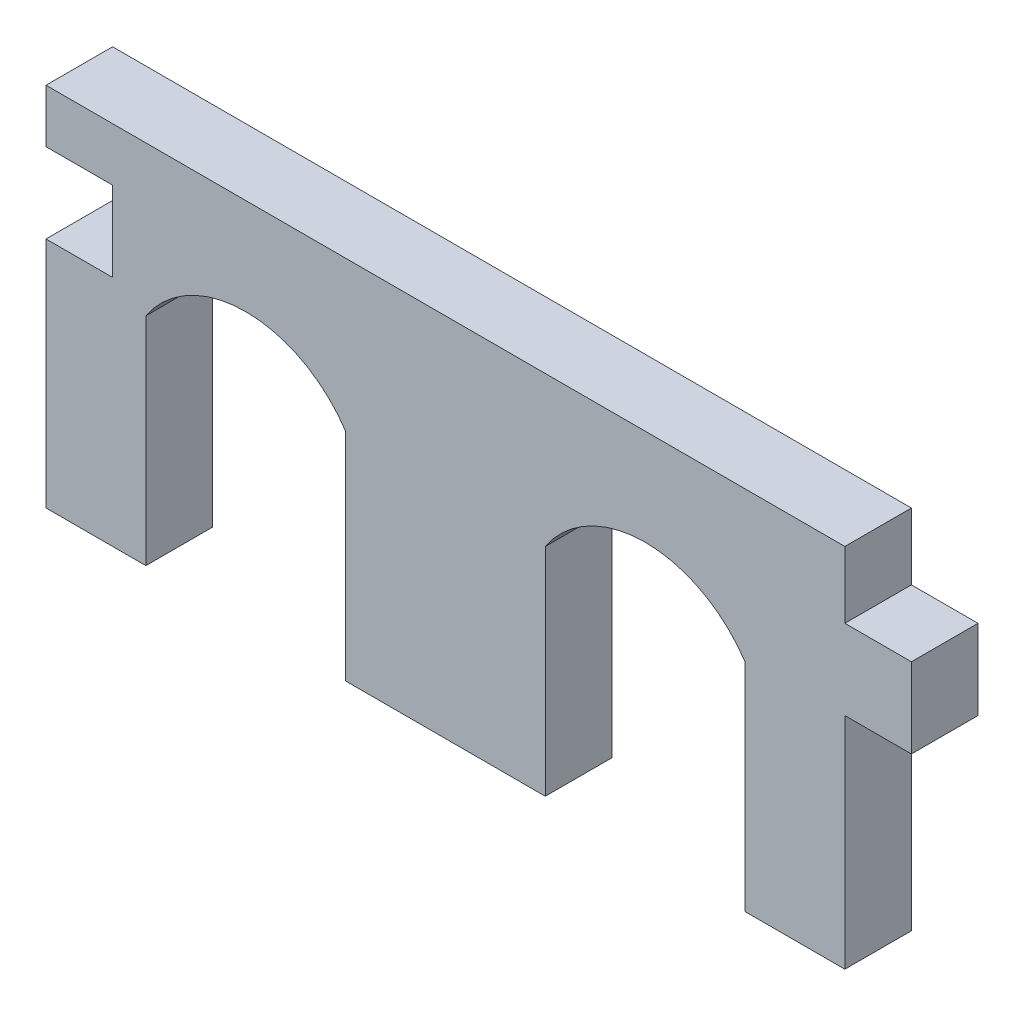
from build123d import *

# Parameters (mm, degrees)
BOSS_EXTRUDE4_DEPTH = 6.35


with BuildPart() as part:
    # Sketch1 → Boss-Extrude4 (new body)
    with BuildSketch(Plane.XY):
        with BuildLine():
            Line((-47.625, 14.2875), (-47.625, -6.35))
            Line((-47.625, -6.35), (-28.575, -6.35))
            Line((-28.575, -6.35), (-28.575, 14.2875))
            ThreePointArc((-28.575, 14.2875), (-19.05, 19.399329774), (-9.525, 14.2875))
            Line((-9.525, 14.2875), (-9.525, -6.35))
            Line((-9.525, -6.35), (0, -6.35))
            Line((0, -6.35), (0, 14.605))
            Line((0, 14.605), (6.35, 14.605))
            Line((6.35, 14.605), (6.35, 22.225))
            Line((6.35, 22.225), (0, 22.225))
            Line((0, 22.225), (0, 28.575))
            Line((0, 28.575), (-76.2, 28.575))
            Line((-76.2, 28.575), (-76.2, 23.495))
            Line((-76.2, 23.495), (-69.85, 23.495))
            Line((-69.85, 23.495), (-69.85, 15.875))
            Line((-69.85, 15.875), (-76.2, 15.875))
            Line((-76.2, 15.875), (-76.2, -6.35))
            Line((-76.2, -6.35), (-66.675, -6.35))
            Line((-66.675, -6.35), (-66.675, 14.2875))
            ThreePointArc((-66.675, 14.2875), (-57.15, 19.399329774), (-47.625, 14.2875))
        make_face()
    extrude(amount=BOSS_EXTRUDE4_DEPTH)


solid = part.part
